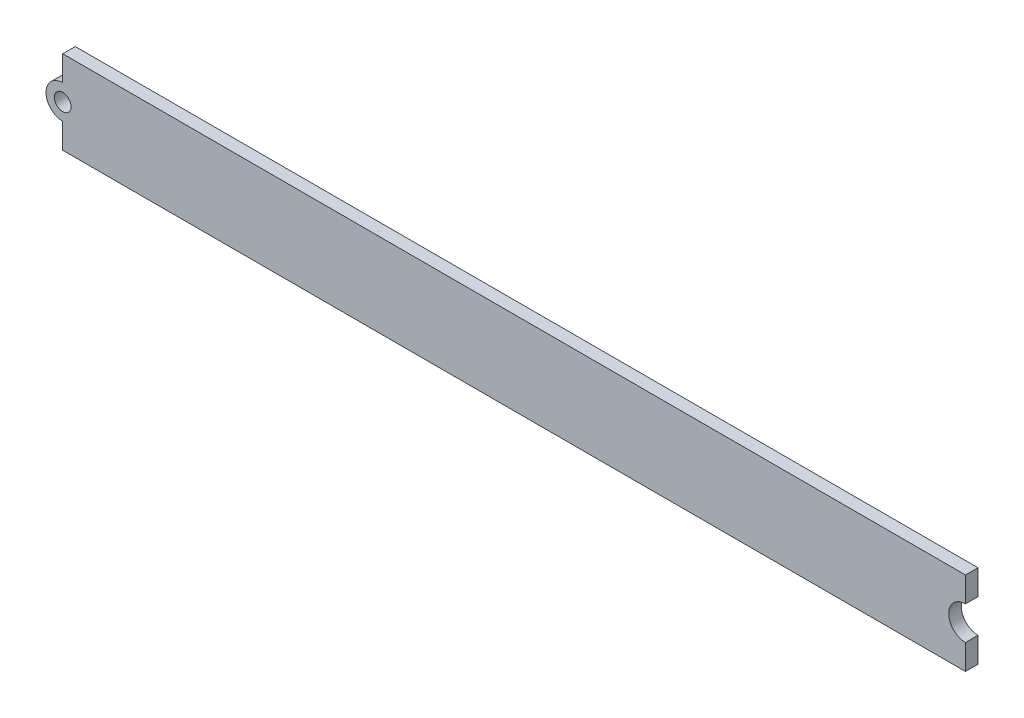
ISO-10303-21;
HEADER;
FILE_DESCRIPTION(('STEP AP214'),'2;1');
FILE_NAME('part.step','',(''),(''),'','','');
FILE_SCHEMA(('AUTOMOTIVE_DESIGN { 1 0 10303 214 1 1 1 1 }'));
ENDSEC;
DATA;
#1=APPLICATION_CONTEXT('core data for automotive mechanical design processes');
#2=APPLICATION_PROTOCOL_DEFINITION('international standard','automotive_design',2000,#1);
#3=PRODUCT_CONTEXT('',#1,'mechanical');
#4=PRODUCT('Part','Part','',(#3));
#5=PRODUCT_RELATED_PRODUCT_CATEGORY('part','',(#4));
#6=PRODUCT_DEFINITION_FORMATION('','',#4);
#7=PRODUCT_DEFINITION_CONTEXT('part definition',#1,'design');
#8=PRODUCT_DEFINITION('design','',#6,#7);
#9=PRODUCT_DEFINITION_SHAPE('','',#8);
#10=(LENGTH_UNIT() NAMED_UNIT(*) SI_UNIT(.MILLI.,.METRE.));
#11=(NAMED_UNIT(*) PLANE_ANGLE_UNIT() SI_UNIT($,.RADIAN.));
#12=(NAMED_UNIT(*) SI_UNIT($,.STERADIAN.) SOLID_ANGLE_UNIT());
#13=UNCERTAINTY_MEASURE_WITH_UNIT(LENGTH_MEASURE(1.E-05),#10,'distance_accuracy_value','');
#14=(GEOMETRIC_REPRESENTATION_CONTEXT(3) GLOBAL_UNCERTAINTY_ASSIGNED_CONTEXT((#13)) GLOBAL_UNIT_ASSIGNED_CONTEXT((#10,
#11,#12)) REPRESENTATION_CONTEXT('',''));
#15=CARTESIAN_POINT('',(0.,0.,0.));
#16=DIRECTION('',(0.,0.,1.));
#17=DIRECTION('',(1.,0.,0.));
#18=AXIS2_PLACEMENT_3D('',#15,#16,#17);
#19=CARTESIAN_POINT('',(-54.,0.,1.5));
#20=DIRECTION('',(0.,0.,1.));
#21=DIRECTION('',(1.,0.,0.));
#22=AXIS2_PLACEMENT_3D('',#19,#20,#21);
#23=PLANE('',#22);
#24=DIRECTION('',(0.,-1.,0.));
#25=VECTOR('',#24,1.);
#26=CARTESIAN_POINT('',(-54.,5.,1.5));
#27=LINE('',#26,#25);
#28=CARTESIAN_POINT('',(-54.,5.,1.5));
#29=VERTEX_POINT('',#28);
#30=CARTESIAN_POINT('',(-54.,2.,1.5));
#31=VERTEX_POINT('',#30);
#32=EDGE_CURVE('E147',#29,#31,#27,.T.);
#33=ORIENTED_EDGE('',*,*,#32,.T.);
#34=CARTESIAN_POINT('',(-54.,0.,1.5));
#35=DIRECTION('',(0.,0.,1.));
#36=DIRECTION('',(1.,0.,0.));
#37=AXIS2_PLACEMENT_3D('',#34,#35,#36);
#38=CIRCLE('',#37,2.);
#39=CARTESIAN_POINT('',(-54.,-2.,1.5));
#40=VERTEX_POINT('',#39);
#41=EDGE_CURVE('E95',#31,#40,#38,.T.);
#42=ORIENTED_EDGE('',*,*,#41,.T.);
#43=DIRECTION('',(0.,-1.,0.));
#44=VECTOR('',#43,1.);
#45=CARTESIAN_POINT('',(-54.,-2.,1.5));
#46=LINE('',#45,#44);
#47=CARTESIAN_POINT('',(-54.,-5.,1.5));
#48=VERTEX_POINT('',#47);
#49=EDGE_CURVE('E162',#40,#48,#46,.T.);
#50=ORIENTED_EDGE('',*,*,#49,.T.);
#51=DIRECTION('',(1.,0.,0.));
#52=VECTOR('',#51,1.);
#53=CARTESIAN_POINT('',(-54.,-5.,1.5));
#54=LINE('',#53,#52);
#55=CARTESIAN_POINT('',(54.,-4.99999999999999,1.5));
#56=VERTEX_POINT('',#55);
#57=EDGE_CURVE('E175',#48,#56,#54,.T.);
#58=ORIENTED_EDGE('',*,*,#57,.T.);
#59=DIRECTION('',(0.,1.,0.));
#60=VECTOR('',#59,1.);
#61=CARTESIAN_POINT('',(54.,-1.99999999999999,1.5));
#62=LINE('',#61,#60);
#63=CARTESIAN_POINT('',(54.,-1.99999999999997,1.5));
#64=VERTEX_POINT('',#63);
#65=EDGE_CURVE('E114',#56,#64,#62,.T.);
#66=ORIENTED_EDGE('',*,*,#65,.T.);
#67=CARTESIAN_POINT('',(54.,0.,1.5));
#68=DIRECTION('',(0.,0.,-1.));
#69=DIRECTION('',(1.,0.,0.));
#70=AXIS2_PLACEMENT_3D('',#67,#68,#69);
#71=CIRCLE('',#70,1.99999999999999);
#72=CARTESIAN_POINT('',(54.,1.99999999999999,1.5));
#73=VERTEX_POINT('',#72);
#74=EDGE_CURVE('E108',#64,#73,#71,.T.);
#75=ORIENTED_EDGE('',*,*,#74,.T.);
#76=DIRECTION('',(0.,1.,0.));
#77=VECTOR('',#76,1.);
#78=CARTESIAN_POINT('',(54.,5.00000000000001,1.5));
#79=LINE('',#78,#77);
#80=CARTESIAN_POINT('',(54.,5.00000000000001,1.5));
#81=VERTEX_POINT('',#80);
#82=EDGE_CURVE('E112',#73,#81,#79,.T.);
#83=ORIENTED_EDGE('',*,*,#82,.T.);
#84=DIRECTION('',(-1.,0.,0.));
#85=VECTOR('',#84,1.);
#86=CARTESIAN_POINT('',(-54.,5.,1.5));
#87=LINE('',#86,#85);
#88=EDGE_CURVE('E52',#81,#29,#87,.T.);
#89=ORIENTED_EDGE('',*,*,#88,.T.);
#90=EDGE_LOOP('',(#33,#42,#50,#58,#66,#75,#83,#89));
#91=FACE_BOUND('',#90,.T.);
#92=CARTESIAN_POINT('',(-54.,0.,1.5));
#93=DIRECTION('',(0.,0.,1.));
#94=DIRECTION('',(1.,0.,0.));
#95=AXIS2_PLACEMENT_3D('',#92,#93,#94);
#96=CIRCLE('',#95,0.999999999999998);
#97=CARTESIAN_POINT('',(-53.,0.,1.5));
#98=VERTEX_POINT('',#97);
#99=EDGE_CURVE('E136',#98,#98,#96,.T.);
#100=ORIENTED_EDGE('',*,*,#99,.F.);
#101=EDGE_LOOP('',(#100));
#102=FACE_BOUND('',#101,.T.);
#103=ADVANCED_FACE('F35',(#91,#102),#23,.T.);
#104=CARTESIAN_POINT('',(-54.,0.,0.));
#105=DIRECTION('',(0.,0.,1.));
#106=DIRECTION('',(1.,0.,0.));
#107=AXIS2_PLACEMENT_3D('',#104,#105,#106);
#108=PLANE('',#107);
#109=DIRECTION('',(0.,-1.,0.));
#110=VECTOR('',#109,1.);
#111=CARTESIAN_POINT('',(-54.,5.,0.));
#112=LINE('',#111,#110);
#113=CARTESIAN_POINT('',(-54.,5.,0.));
#114=VERTEX_POINT('',#113);
#115=CARTESIAN_POINT('',(-54.,2.,0.));
#116=VERTEX_POINT('',#115);
#117=EDGE_CURVE('E132',#114,#116,#112,.T.);
#118=ORIENTED_EDGE('',*,*,#117,.F.);
#119=DIRECTION('',(-1.,0.,0.));
#120=VECTOR('',#119,1.);
#121=CARTESIAN_POINT('',(-54.,5.,0.));
#122=LINE('',#121,#120);
#123=CARTESIAN_POINT('',(54.,5.00000000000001,0.));
#124=VERTEX_POINT('',#123);
#125=EDGE_CURVE('E87',#124,#114,#122,.T.);
#126=ORIENTED_EDGE('',*,*,#125,.F.);
#127=DIRECTION('',(0.,1.,0.));
#128=VECTOR('',#127,1.);
#129=CARTESIAN_POINT('',(54.,5.00000000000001,0.));
#130=LINE('',#129,#128);
#131=CARTESIAN_POINT('',(54.,1.99999999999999,0.));
#132=VERTEX_POINT('',#131);
#133=EDGE_CURVE('E81',#132,#124,#130,.T.);
#134=ORIENTED_EDGE('',*,*,#133,.F.);
#135=CARTESIAN_POINT('',(54.,0.,0.));
#136=DIRECTION('',(0.,0.,-1.));
#137=DIRECTION('',(1.,0.,0.));
#138=AXIS2_PLACEMENT_3D('',#135,#136,#137);
#139=CIRCLE('',#138,1.99999999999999);
#140=CARTESIAN_POINT('',(54.,-1.99999999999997,0.));
#141=VERTEX_POINT('',#140);
#142=EDGE_CURVE('E122',#141,#132,#139,.T.);
#143=ORIENTED_EDGE('',*,*,#142,.F.);
#144=DIRECTION('',(0.,1.,0.));
#145=VECTOR('',#144,1.);
#146=CARTESIAN_POINT('',(54.,-1.99999999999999,0.));
#147=LINE('',#146,#145);
#148=CARTESIAN_POINT('',(54.,-4.99999999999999,0.));
#149=VERTEX_POINT('',#148);
#150=EDGE_CURVE('E142',#149,#141,#147,.T.);
#151=ORIENTED_EDGE('',*,*,#150,.F.);
#152=DIRECTION('',(1.,0.,0.));
#153=VECTOR('',#152,1.);
#154=CARTESIAN_POINT('',(-54.,-5.,0.));
#155=LINE('',#154,#153);
#156=CARTESIAN_POINT('',(-54.,-5.,0.));
#157=VERTEX_POINT('',#156);
#158=EDGE_CURVE('E140',#157,#149,#155,.T.);
#159=ORIENTED_EDGE('',*,*,#158,.F.);
#160=DIRECTION('',(0.,-1.,0.));
#161=VECTOR('',#160,1.);
#162=CARTESIAN_POINT('',(-54.,-2.,0.));
#163=LINE('',#162,#161);
#164=CARTESIAN_POINT('',(-54.,-2.,0.));
#165=VERTEX_POINT('',#164);
#166=EDGE_CURVE('E138',#165,#157,#163,.T.);
#167=ORIENTED_EDGE('',*,*,#166,.F.);
#168=CARTESIAN_POINT('',(-54.,0.,0.));
#169=DIRECTION('',(0.,0.,1.));
#170=DIRECTION('',(1.,0.,0.));
#171=AXIS2_PLACEMENT_3D('',#168,#169,#170);
#172=CIRCLE('',#171,2.);
#173=EDGE_CURVE('E135',#116,#165,#172,.T.);
#174=ORIENTED_EDGE('',*,*,#173,.F.);
#175=EDGE_LOOP('',(#118,#126,#134,#143,#151,#159,#167,#174));
#176=FACE_BOUND('',#175,.T.);
#177=CARTESIAN_POINT('',(-54.,0.,0.));
#178=DIRECTION('',(0.,0.,1.));
#179=DIRECTION('',(1.,0.,0.));
#180=AXIS2_PLACEMENT_3D('',#177,#178,#179);
#181=CIRCLE('',#180,0.999999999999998);
#182=CARTESIAN_POINT('',(-53.,0.,0.));
#183=VERTEX_POINT('',#182);
#184=EDGE_CURVE('E181',#183,#183,#181,.T.);
#185=ORIENTED_EDGE('',*,*,#184,.T.);
#186=EDGE_LOOP('',(#185));
#187=FACE_BOUND('',#186,.T.);
#188=ADVANCED_FACE('F166',(#176,#187),#108,.F.);
#189=CARTESIAN_POINT('',(-54.,5.,1.5));
#190=DIRECTION('',(1.,0.,0.));
#191=DIRECTION('',(0.,0.,-1.));
#192=AXIS2_PLACEMENT_3D('',#189,#190,#191);
#193=PLANE('',#192);
#194=ORIENTED_EDGE('',*,*,#117,.T.);
#195=DIRECTION('',(0.,0.,-1.));
#196=VECTOR('',#195,1.);
#197=CARTESIAN_POINT('',(-54.,2.,1.5));
#198=LINE('',#197,#196);
#199=EDGE_CURVE('E11',#31,#116,#198,.T.);
#200=ORIENTED_EDGE('',*,*,#199,.F.);
#201=ORIENTED_EDGE('',*,*,#32,.F.);
#202=DIRECTION('',(0.,0.,-1.));
#203=VECTOR('',#202,1.);
#204=CARTESIAN_POINT('',(-54.,5.,1.5));
#205=LINE('',#204,#203);
#206=EDGE_CURVE('E128',#29,#114,#205,.T.);
#207=ORIENTED_EDGE('',*,*,#206,.T.);
#208=EDGE_LOOP('',(#194,#200,#201,#207));
#209=FACE_BOUND('',#208,.T.);
#210=ADVANCED_FACE('F37',(#209),#193,.F.);
#211=CARTESIAN_POINT('',(-54.,0.,1.5));
#212=DIRECTION('',(0.,0.,-1.));
#213=DIRECTION('',(-1.,0.,0.));
#214=AXIS2_PLACEMENT_3D('',#211,#212,#213);
#215=CYLINDRICAL_SURFACE('',#214,2.);
#216=ORIENTED_EDGE('',*,*,#173,.T.);
#217=DIRECTION('',(0.,0.,-1.));
#218=VECTOR('',#217,1.);
#219=CARTESIAN_POINT('',(-54.,-2.,1.5));
#220=LINE('',#219,#218);
#221=EDGE_CURVE('E44',#40,#165,#220,.T.);
#222=ORIENTED_EDGE('',*,*,#221,.F.);
#223=ORIENTED_EDGE('',*,*,#41,.F.);
#224=ORIENTED_EDGE('',*,*,#199,.T.);
#225=EDGE_LOOP('',(#216,#222,#223,#224));
#226=FACE_BOUND('',#225,.T.);
#227=ADVANCED_FACE('F209',(#226),#215,.T.);
#228=CARTESIAN_POINT('',(-54.,-2.,1.5));
#229=DIRECTION('',(1.,0.,0.));
#230=DIRECTION('',(0.,0.,-1.));
#231=AXIS2_PLACEMENT_3D('',#228,#229,#230);
#232=PLANE('',#231);
#233=ORIENTED_EDGE('',*,*,#166,.T.);
#234=DIRECTION('',(0.,0.,-1.));
#235=VECTOR('',#234,1.);
#236=CARTESIAN_POINT('',(-54.,-5.,1.5));
#237=LINE('',#236,#235);
#238=EDGE_CURVE('E154',#48,#157,#237,.T.);
#239=ORIENTED_EDGE('',*,*,#238,.F.);
#240=ORIENTED_EDGE('',*,*,#49,.F.);
#241=ORIENTED_EDGE('',*,*,#221,.T.);
#242=EDGE_LOOP('',(#233,#239,#240,#241));
#243=FACE_BOUND('',#242,.T.);
#244=ADVANCED_FACE('F160',(#243),#232,.F.);
#245=CARTESIAN_POINT('',(-54.,-5.,1.5));
#246=DIRECTION('',(0.,1.,0.));
#247=DIRECTION('',(-1.,0.,0.));
#248=AXIS2_PLACEMENT_3D('',#245,#246,#247);
#249=PLANE('',#248);
#250=ORIENTED_EDGE('',*,*,#158,.T.);
#251=DIRECTION('',(0.,0.,-1.));
#252=VECTOR('',#251,1.);
#253=CARTESIAN_POINT('',(54.,-4.99999999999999,1.5));
#254=LINE('',#253,#252);
#255=EDGE_CURVE('E151',#56,#149,#254,.T.);
#256=ORIENTED_EDGE('',*,*,#255,.F.);
#257=ORIENTED_EDGE('',*,*,#57,.F.);
#258=ORIENTED_EDGE('',*,*,#238,.T.);
#259=EDGE_LOOP('',(#250,#256,#257,#258));
#260=FACE_BOUND('',#259,.T.);
#261=ADVANCED_FACE('F171',(#260),#249,.F.);
#262=CARTESIAN_POINT('',(54.,-1.99999999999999,1.5));
#263=DIRECTION('',(-1.,0.,0.));
#264=DIRECTION('',(0.,0.,1.));
#265=AXIS2_PLACEMENT_3D('',#262,#263,#264);
#266=PLANE('',#265);
#267=ORIENTED_EDGE('',*,*,#150,.T.);
#268=DIRECTION('',(0.,0.,-1.));
#269=VECTOR('',#268,1.);
#270=CARTESIAN_POINT('',(54.,-1.99999999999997,1.5));
#271=LINE('',#270,#269);
#272=EDGE_CURVE('E123',#64,#141,#271,.T.);
#273=ORIENTED_EDGE('',*,*,#272,.F.);
#274=ORIENTED_EDGE('',*,*,#65,.F.);
#275=ORIENTED_EDGE('',*,*,#255,.T.);
#276=EDGE_LOOP('',(#267,#273,#274,#275));
#277=FACE_BOUND('',#276,.T.);
#278=ADVANCED_FACE('F174',(#277),#266,.F.);
#279=CARTESIAN_POINT('',(54.,0.,1.5));
#280=DIRECTION('',(0.,0.,-1.));
#281=DIRECTION('',(-1.,0.,0.));
#282=AXIS2_PLACEMENT_3D('',#279,#280,#281);
#283=CYLINDRICAL_SURFACE('',#282,1.99999999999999);
#284=ORIENTED_EDGE('',*,*,#142,.T.);
#285=DIRECTION('',(0.,0.,-1.));
#286=VECTOR('',#285,1.);
#287=CARTESIAN_POINT('',(54.,1.99999999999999,1.5));
#288=LINE('',#287,#286);
#289=EDGE_CURVE('E119',#73,#132,#288,.T.);
#290=ORIENTED_EDGE('',*,*,#289,.F.);
#291=ORIENTED_EDGE('',*,*,#74,.F.);
#292=ORIENTED_EDGE('',*,*,#272,.T.);
#293=EDGE_LOOP('',(#284,#290,#291,#292));
#294=FACE_BOUND('',#293,.T.);
#295=ADVANCED_FACE('F120',(#294),#283,.F.);
#296=CARTESIAN_POINT('',(54.,5.00000000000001,1.5));
#297=DIRECTION('',(-1.,0.,0.));
#298=DIRECTION('',(0.,0.,1.));
#299=AXIS2_PLACEMENT_3D('',#296,#297,#298);
#300=PLANE('',#299);
#301=ORIENTED_EDGE('',*,*,#133,.T.);
#302=DIRECTION('',(0.,0.,-1.));
#303=VECTOR('',#302,1.);
#304=CARTESIAN_POINT('',(54.,5.00000000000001,1.5));
#305=LINE('',#304,#303);
#306=EDGE_CURVE('E124',#81,#124,#305,.T.);
#307=ORIENTED_EDGE('',*,*,#306,.F.);
#308=ORIENTED_EDGE('',*,*,#82,.F.);
#309=ORIENTED_EDGE('',*,*,#289,.T.);
#310=EDGE_LOOP('',(#301,#307,#308,#309));
#311=FACE_BOUND('',#310,.T.);
#312=ADVANCED_FACE('F126',(#311),#300,.F.);
#313=CARTESIAN_POINT('',(-54.,5.,1.5));
#314=DIRECTION('',(0.,-1.,0.));
#315=DIRECTION('',(1.,0.,0.));
#316=AXIS2_PLACEMENT_3D('',#313,#314,#315);
#317=PLANE('',#316);
#318=ORIENTED_EDGE('',*,*,#125,.T.);
#319=ORIENTED_EDGE('',*,*,#206,.F.);
#320=ORIENTED_EDGE('',*,*,#88,.F.);
#321=ORIENTED_EDGE('',*,*,#306,.T.);
#322=EDGE_LOOP('',(#318,#319,#320,#321));
#323=FACE_BOUND('',#322,.T.);
#324=ADVANCED_FACE('F197',(#323),#317,.F.);
#325=CARTESIAN_POINT('',(-54.,0.,1.5));
#326=DIRECTION('',(0.,0.,-1.));
#327=DIRECTION('',(-1.,0.,0.));
#328=AXIS2_PLACEMENT_3D('',#325,#326,#327);
#329=CYLINDRICAL_SURFACE('',#328,0.999999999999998);
#330=ORIENTED_EDGE('',*,*,#99,.T.);
#331=EDGE_LOOP('',(#330));
#332=FACE_BOUND('',#331,.T.);
#333=ORIENTED_EDGE('',*,*,#184,.F.);
#334=EDGE_LOOP('',(#333));
#335=FACE_BOUND('',#334,.T.);
#336=ADVANCED_FACE('F187',(#332,#335),#329,.F.);
#337=CLOSED_SHELL('',(#103,#188,#210,#227,#244,#261,#278,#295,#312,#324,#336));
#338=MANIFOLD_SOLID_BREP('B2',#337);
#339=ADVANCED_BREP_SHAPE_REPRESENTATION('',(#18,#338),#14);
#340=SHAPE_DEFINITION_REPRESENTATION(#9,#339);
ENDSEC;
END-ISO-10303-21;
